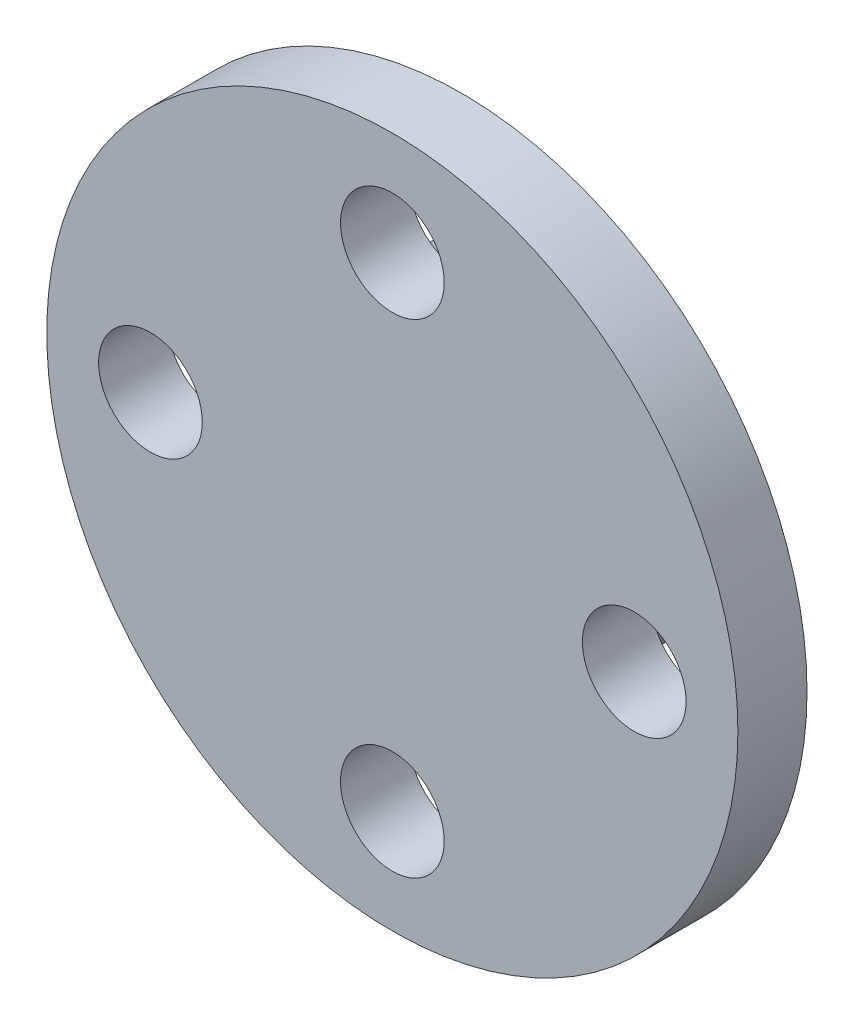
from build123d import *

# Parameters (mm, degrees)
SKETCH_1_R      = 4.75
EXTRUDE_1_DEPTH = 3.6
SKETCH_2_R      = 10
SKETCH_2_R_2    = 1.5
EXTRUDE_2_DEPTH = 2


with BuildPart() as part:
    # Sketch 1 → Extrude 1 (new body)
    with BuildSketch(Plane.XY):
        Circle(SKETCH_1_R)
    extrude(amount=EXTRUDE_1_DEPTH)

    # Sketch 2 → Extrude 2 (add)
    with BuildSketch(Plane.XY.offset(3.6)):
        Circle(SKETCH_2_R)
        with Locations((0, 7)):
            Circle(SKETCH_2_R_2, mode=Mode.SUBTRACT)
        with Locations((7, 0)):
            Circle(SKETCH_2_R_2, mode=Mode.SUBTRACT)
        with Locations((0, -7)):
            Circle(SKETCH_2_R_2, mode=Mode.SUBTRACT)
        with Locations((-7, 0)):
            Circle(SKETCH_2_R_2, mode=Mode.SUBTRACT)
    extrude(amount=EXTRUDE_2_DEPTH)


solid = part.part
